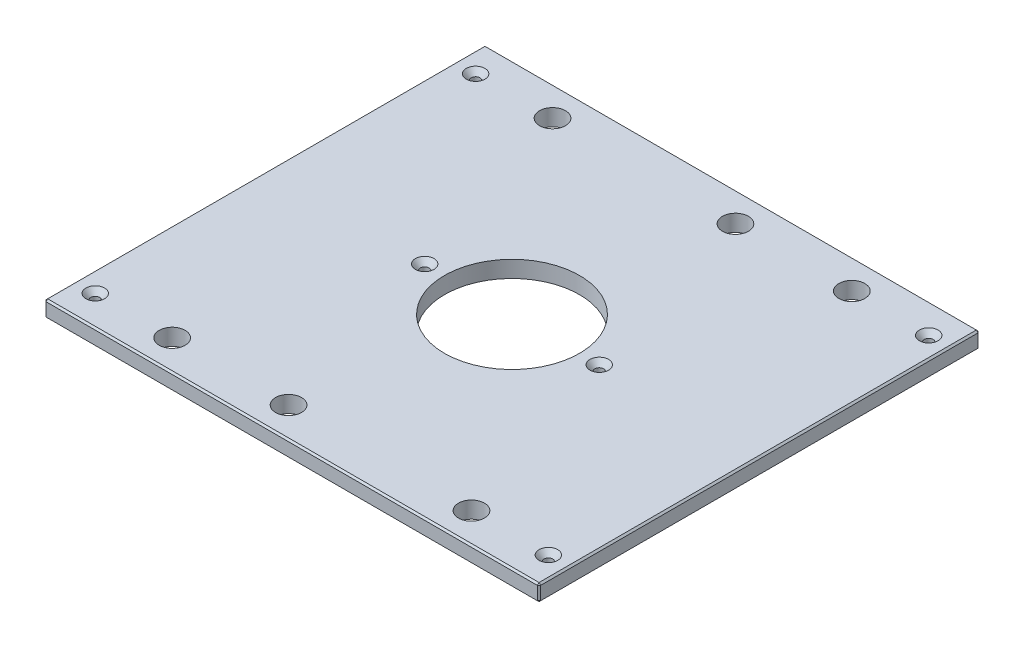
from build123d import *

# Parameters (mm, degrees)
SKETCH1_W                                        = 377.825
SKETCH1_H                                        = 336.55
BOSS_EXTRUDE1_DEPTH                              = 12.7
SKETCH13_R                                       = 51.562
CUT_EXTRUDE6_DEPTH                               = 254.3094911
F_25_32_0_78125_DIAMETER_HOLE1_D                 = 19.84375
CHAMFER2_SIZE                                    = 1.27
CSK_FOR_1_4_FLAT_HEAD_MACHINE_SCREW1_D           = 6.7564
CSK_FOR_1_4_FLAT_HEAD_MACHINE_SCREW1_CSINK_D     = 14.2748
CSK_FOR_1_4_FLAT_HEAD_MACHINE_SCREW1_CSINK_ANGLE = 82


with BuildPart() as part:
    # Sketch1 → Boss-Extrude1 (new body)
    with BuildSketch(Plane(origin=(0, 0, 0), x_dir=(1, 0, 0), z_dir=(0, 1, 0))):
        Rectangle(SKETCH1_W, SKETCH1_H)
    extrude(amount=BOSS_EXTRUDE1_DEPTH)

    # Sketch13 → Cut-Extrude6 (cut, through all)
    with BuildSketch(Plane(origin=(0, 12.7, 0), x_dir=(1, 0, 0), z_dir=(0, 1, 0))):
        with Locations(Location((0, 0, 0), (0, 0, 270))):
            Circle(SKETCH13_R)
    extrude(amount=-CUT_EXTRUDE6_DEPTH, mode=Mode.SUBTRACT)

    # 25_32 _0.78125_ Diameter Hole1 (through all)
    with Locations(Plane(origin=(0, 12.7, 0), x_dir=(1, 0, 0), z_dir=(0, 1, 0))):
        with Locations((114.3, 145.25498), (-114.3, 145.25498), (114.3, -145.25498), (-114.3, -145.25498), (25.4, 145.25498), (-25.4, -145.25498)):
            Hole(F_25_32_0_78125_DIAMETER_HOLE1_D / 2)

    # Chamfer2
    chamfer2_edges = [part.edges().sort_by_distance(p)[0] for p in [
        (188.9125, 12.7, 0),
        (0, 12.7, -168.275),
        (-188.9125, 12.7, 0),
        (0, 0, -168.275),
        (188.9125, 0, 0),
        (0, 0, 168.275),
        (-188.9125, 0, 0),
        (0, 12.7, 168.275),
        (-188.9125, 6.35, -168.275),
        (188.9125, 6.35, -168.275),
        (188.9125, 6.35, 168.275),
        (-188.9125, 6.35, 168.275),
    ]]
    chamfer(chamfer2_edges, length=CHAMFER2_SIZE)

    # CSK for 1_4 Flat Head Machine Screw1 (through all)
    with Locations(Plane(origin=(0, 12.7, 0), x_dir=(1, 0, 0), z_dir=(0, 1, 0))):
        with Locations((173.0375, 145.25498), (173.0375, -145.25498), (-173.0375, -145.25498), (-66.675, 0), (66.675, 0), (-173.0375, 145.25498), (-114.3, 145.25498), (-114.3, -145.25498)):
            CounterSinkHole(CSK_FOR_1_4_FLAT_HEAD_MACHINE_SCREW1_D / 2, CSK_FOR_1_4_FLAT_HEAD_MACHINE_SCREW1_CSINK_D / 2, counter_sink_angle=CSK_FOR_1_4_FLAT_HEAD_MACHINE_SCREW1_CSINK_ANGLE)


solid = part.part
